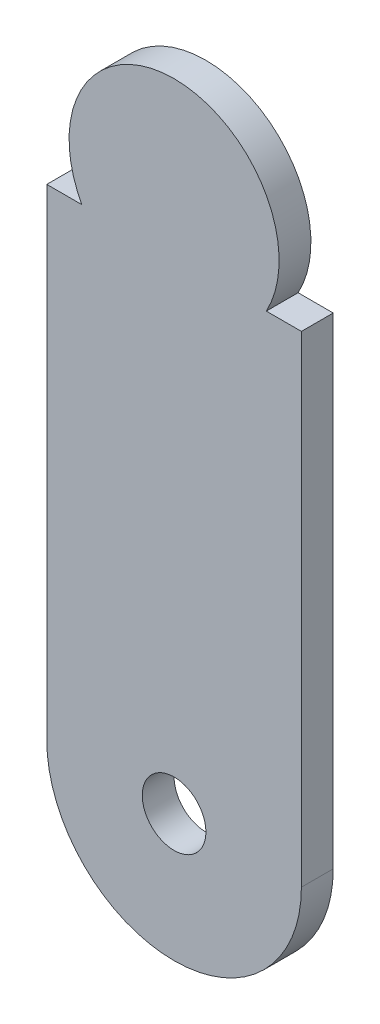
from build123d import *

# Parameters (mm, degrees)
SKETCH1_R           = 3.175
BOSS_EXTRUDE1_DEPTH = 3.175


with BuildPart() as part:
    # Sketch1 → Boss-Extrude1 (new body)
    with BuildSketch(Plane.XY):
        with BuildLine():
            Line((9.198471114, 16.266134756), (12.7, 16.266134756))
            Line((12.7, 16.266134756), (12.7, -31.75))
            ThreePointArc((12.7, -31.75), (0, -44.45), (-12.7, -31.75))
            Line((-12.7, -31.75), (-12.7, 16.266134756))
            Line((-12.7, 16.266134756), (-9.198471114, 16.266134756))
            ThreePointArc((-9.198471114, 16.266134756), (0, 31.75), (9.198471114, 16.266134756))
        make_face()
        with Locations((0, -31.75)):
            Circle(SKETCH1_R, mode=Mode.SUBTRACT)
    extrude(amount=BOSS_EXTRUDE1_DEPTH)


solid = part.part
